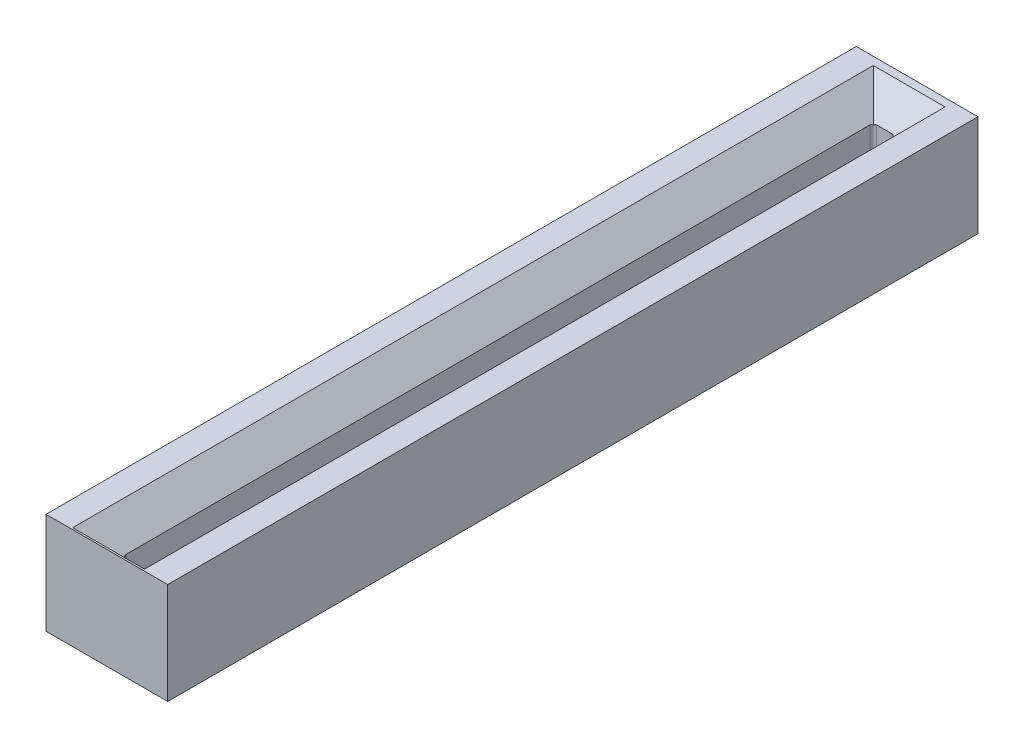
from build123d import *

# Parameters (mm, degrees)
SKETCH2_W               = 488.25
SKETCH2_H               = 3412.05
SKETCH2_W_2             = 88.2
SKETCH2_H_2             = 3012
BOSS_EXTRUDE2_DEPTH     = 203.2
CHAMFER1_SIZE           = 100
FILLET1_R               = 13
CUT_EXTRUDE1_DEPTH      = 1736.341048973
CUT_EXTRUDE1_DEPTH_BACK = 1736.341048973
SKETCH4_W               = 816.333644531
SKETCH4_H               = 394.00137305
SKETCH4_W_2             = 609.664479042
SKETCH4_H_2             = 147.643874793


with BuildPart() as part:
    # Sketch2 → Boss-Extrude2 (new, symmetric)
    with BuildSketch(Plane(origin=(0, 0, 0), x_dir=(-1, 0, 0), z_dir=(0, 1, 0))):
        Rectangle(SKETCH2_W, SKETCH2_H)
        Rectangle(SKETCH2_W_2, SKETCH2_H_2, mode=Mode.SUBTRACT)
    extrude(amount=BOSS_EXTRUDE2_DEPTH, both=True)

    # Chamfer1
    chamfer1_edges = [part.edges().sort_by_distance(p)[0] for p in [
        (-44.1, -203.2, 0),
        (0, -203.2, 1506),
        (44.1, -203.2, 0),
        (0, -203.2, -1506),
        (-44.1, 203.2, 0),
        (0, 203.2, 1506),
        (44.1, 203.2, 0),
        (0, 203.2, -1506),
    ]]
    chamfer(chamfer1_edges, length=CHAMFER1_SIZE)

    # Fillet1
    fillet1_edges = [part.edges().sort_by_distance(p)[0] for p in [
        (44.1, 0, 1506),
        (44.1, 0, -1506),
        (-44.1, 0, -1506),
        (-44.1, 0, 1506),
    ]]
    fillet(fillet1_edges, radius=FILLET1_R)

    # Sketch4 → Cut-Extrude1 (cut, two sides: drawn at the far end of the back side and taken through both)
    with BuildSketch(Plane(origin=(0, 0, 0), x_dir=(-1, 0, 0), z_dir=(0, 1, 0)).offset(-CUT_EXTRUDE1_DEPTH_BACK)):
        with Locations((72.72624986, -1835.000686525)):
            Rectangle(SKETCH4_W, SKETCH4_H)
        with Locations((-7.316495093, 1686.821937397)):
            Rectangle(SKETCH4_W_2, SKETCH4_H_2)
    extrude(amount=CUT_EXTRUDE1_DEPTH + CUT_EXTRUDE1_DEPTH_BACK, mode=Mode.SUBTRACT)


solid = part.part
